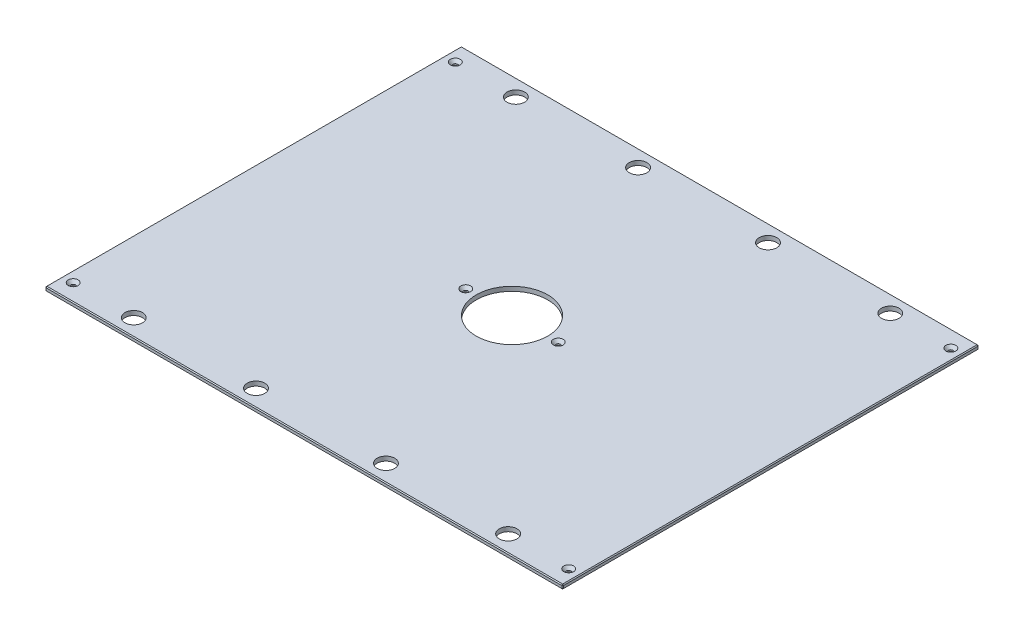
from build123d import *

# Parameters (mm, degrees)
SKETCH1_W                                     = 746.125
SKETCH1_H                                     = 600.075
BOSS_EXTRUDE1_DEPTH                           = 6.35
SKETCH13_R                                    = 51.562
CUT_EXTRUDE6_DEPTH                            = 479.788526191
F_1_1_DIAMETER_HOLE1_D                        = 25.4
CHAMFER2_SIZE                                 = 1.27
CSK_FOR_1_4_FLAT_HEAD_MACHINE_SCREW1_AT_COUNT = 2
CSK_FOR_1_4_FLAT_HEAD_MACHINE_SCREW1_AT_PITCH = 550.85996
CSK_FOR_1_4_FLAT_HEAD_MACHINE_SCREW1_2_COUNT  = 2
CSK_FOR_1_4_FLAT_HEAD_MACHINE_SCREW1_2_PITCH  = 902.096633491
CSK_FOR_1_4_FLAT_HEAD_MACHINE_SCREW1_3_COUNT  = 2
CSK_FOR_1_4_FLAT_HEAD_MACHINE_SCREW1_3_PITCH  = 505.490942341
CSK_FOR_1_4_FLAT_HEAD_MACHINE_SCREW1_4_COUNT  = 2
CSK_FOR_1_4_FLAT_HEAD_MACHINE_SCREW1_4_PITCH  = 400.323852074
CSK_FOR_1_4_FLAT_HEAD_MACHINE_SCREW1_5_COUNT  = 2
CSK_FOR_1_4_FLAT_HEAD_MACHINE_SCREW1_5_PITCH  = 714.375
CSK_FOR_1_4_FLAT_HEAD_MACHINE_SCREW1_6_COUNT  = 2
CSK_FOR_1_4_FLAT_HEAD_MACHINE_SCREW1_6_PITCH  = 627.0625
CSK_FOR_1_4_FLAT_HEAD_MACHINE_SCREW1_7_COUNT  = 2
CSK_FOR_1_4_FLAT_HEAD_MACHINE_SCREW1_7_PITCH  = 834.658058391


with BuildPart() as part:
    # Sketch1 → Boss-Extrude1 (new body)
    with BuildSketch(Plane(origin=(0, 0, 0), x_dir=(1, 0, 0), z_dir=(0, 1, 0))):
        Rectangle(SKETCH1_W, SKETCH1_H)
    extrude(amount=BOSS_EXTRUDE1_DEPTH)

    # Sketch13 → Cut-Extrude6 (cut, through all)
    with BuildSketch(Plane(origin=(0, 6.35, 0), x_dir=(1, 0, 0), z_dir=(0, 1, 0))):
        with Locations(Location((0, 0, 0), (0, 0, 270))):
            Circle(SKETCH13_R)
    extrude(amount=-CUT_EXTRUDE6_DEPTH, mode=Mode.SUBTRACT)

    # 1 _1_ Diameter Hole1 (through all)
    with Locations(Plane(origin=(0, 6.35, 0), x_dir=(1, 0, 0), z_dir=(0, 1, 0))):
        with Locations((269.875, 275.42998), (-269.875, 275.42998), (269.875, -275.42998), (-269.875, -275.42998), (-93.6625, 275.42998), (93.6625, 275.42998), (93.6625, -275.42998), (-93.6625, -275.42998)):
            Hole(F_1_1_DIAMETER_HOLE1_D / 2)

    # Chamfer2
    chamfer2_edges = [part.edges().sort_by_distance(p)[0] for p in [
        (373.0625, 6.35, 0),
        (0, 6.35, -300.0375),
        (-373.0625, 6.35, 0),
        (0, 0, -300.0375),
        (373.0625, 0, 0),
        (0, 0, 300.0375),
        (-373.0625, 0, 0),
        (0, 6.35, 300.0375),
        (-373.0625, 3.175, -300.0375),
        (373.0625, 3.175, -300.0375),
        (373.0625, 3.175, 300.0375),
        (-373.0625, 3.175, 300.0375),
    ]]
    chamfer(chamfer2_edges, length=CHAMFER2_SIZE)

    # Sketch24 → CSK for 1_4 Flat Head Machine Screw1 (revolve, cut)
    with BuildSketch(Plane(origin=(357.1875, 6.35, -275.42998), x_dir=(0, 0, 1), z_dir=(1, 0, 0))):
        Polygon((0, 0), (0, 6.35), (3.3782, 6.35), (3.3782, 4.324464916), (7.1374, 0), align=None)
    csk_for_1_4_flat_head_machine_screw1 = revolve(axis=Axis((357.1875, 12.7, -275.42998), (0, -1, 0)), mode=Mode.SUBTRACT)

    # CSK for 1_4 Flat Head Machine Screw1 at: CSK for 1_4 Flat Head Machine Screw1 ×2
    with Locations(*[(0, 0, i * CSK_FOR_1_4_FLAT_HEAD_MACHINE_SCREW1_AT_PITCH) for i in range(1, CSK_FOR_1_4_FLAT_HEAD_MACHINE_SCREW1_AT_COUNT)]):
        add(csk_for_1_4_flat_head_machine_screw1, mode=Mode.SUBTRACT)

    # CSK for 1_4 Flat Head Machine Screw1 2: CSK for 1_4 Flat Head Machine Screw1 ×2
    with Locations(*[Vector(-0.7919051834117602, 0, 0.6106440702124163) * (i * CSK_FOR_1_4_FLAT_HEAD_MACHINE_SCREW1_2_PITCH) for i in range(1, CSK_FOR_1_4_FLAT_HEAD_MACHINE_SCREW1_2_COUNT)]):
        add(csk_for_1_4_flat_head_machine_screw1, mode=Mode.SUBTRACT)

    # CSK for 1_4 Flat Head Machine Screw1 3: CSK for 1_4 Flat Head Machine Screw1 ×2
    with Locations(*[Vector(-0.8385165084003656, 0, 0.5448761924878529) * (i * CSK_FOR_1_4_FLAT_HEAD_MACHINE_SCREW1_3_PITCH) for i in range(1, CSK_FOR_1_4_FLAT_HEAD_MACHINE_SCREW1_3_COUNT)]):
        add(csk_for_1_4_flat_head_machine_screw1, mode=Mode.SUBTRACT)

    # CSK for 1_4 Flat Head Machine Screw1 4: CSK for 1_4 Flat Head Machine Screw1 ×2
    with Locations(*[Vector(-0.7256937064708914, 0, 0.6880179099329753) * (i * CSK_FOR_1_4_FLAT_HEAD_MACHINE_SCREW1_4_PITCH) for i in range(1, CSK_FOR_1_4_FLAT_HEAD_MACHINE_SCREW1_4_COUNT)]):
        add(csk_for_1_4_flat_head_machine_screw1, mode=Mode.SUBTRACT)

    # CSK for 1_4 Flat Head Machine Screw1 5: CSK for 1_4 Flat Head Machine Screw1 ×2
    with Locations(*[(-i * CSK_FOR_1_4_FLAT_HEAD_MACHINE_SCREW1_5_PITCH, 0, 0) for i in range(1, CSK_FOR_1_4_FLAT_HEAD_MACHINE_SCREW1_5_COUNT)]):
        add(csk_for_1_4_flat_head_machine_screw1, mode=Mode.SUBTRACT)

    # CSK for 1_4 Flat Head Machine Screw1 6: CSK for 1_4 Flat Head Machine Screw1 ×2
    with Locations(*[(-i * CSK_FOR_1_4_FLAT_HEAD_MACHINE_SCREW1_6_PITCH, 0, 0) for i in range(1, CSK_FOR_1_4_FLAT_HEAD_MACHINE_SCREW1_6_COUNT)]):
        add(csk_for_1_4_flat_head_machine_screw1, mode=Mode.SUBTRACT)

    # CSK for 1_4 Flat Head Machine Screw1 7: CSK for 1_4 Flat Head Machine Screw1 ×2
    with Locations(*[Vector(-0.7512807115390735, 0, 0.6599827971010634) * (i * CSK_FOR_1_4_FLAT_HEAD_MACHINE_SCREW1_7_PITCH) for i in range(1, CSK_FOR_1_4_FLAT_HEAD_MACHINE_SCREW1_7_COUNT)]):
        add(csk_for_1_4_flat_head_machine_screw1, mode=Mode.SUBTRACT)


solid = part.part
